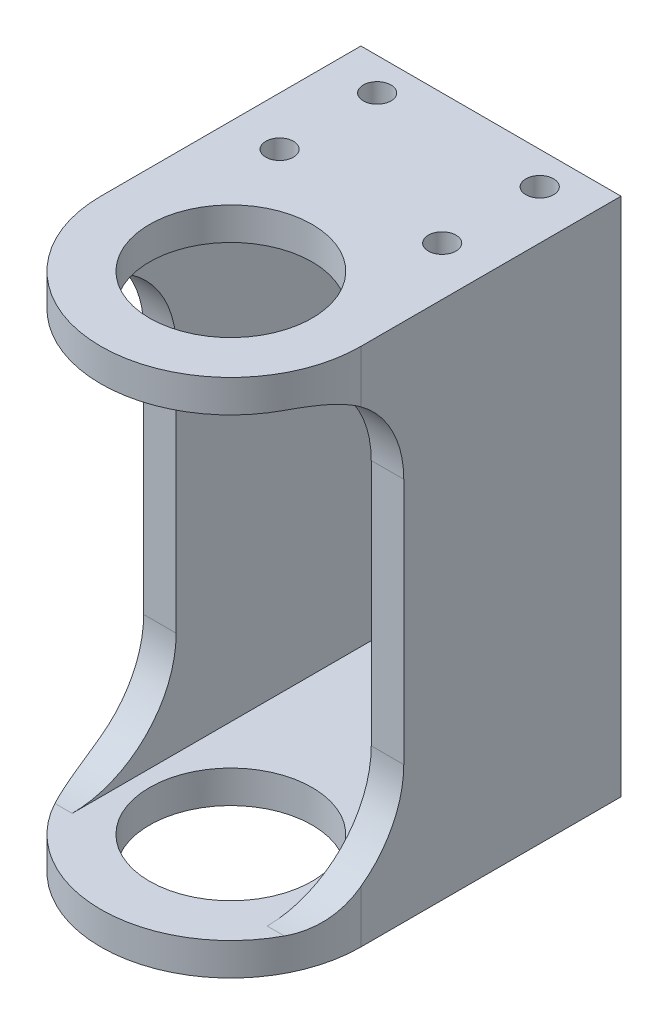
from build123d import *

# Parameters (mm, degrees)
SKETCH1_W                 = 25.4
SKETCH1_H                 = 50.8
SKETCH1_W_2               = 19.05
SKETCH1_H_2               = 44.45
EXTRUDE1_DEPTH            = 38.1
SKETCH2_R                 = 7.9375
CUT_EXTRUDE1_DEPTH        = 65.757547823
SKETCH3_W                 = 24.30883312
SKETCH3_H                 = 44.45
CUT_EXTRUDE2_DEPTH        = 53.363441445
F_6_32_TAPPED_HOLE1_D     = 2.7051
F_6_32_TAPPED_HOLE1_DEPTH = 3.175
FILLET2_R                 = 10.16


with BuildPart() as part:
    # Sketch1 → Extrude1 (new body)
    with BuildSketch(Plane.XY):
        Rectangle(SKETCH1_W, SKETCH1_H)
        Rectangle(SKETCH1_W_2, SKETCH1_H_2, mode=Mode.SUBTRACT)
    extrude(amount=EXTRUDE1_DEPTH)

    # Sketch2 → Cut-Extrude1 (cut, through all)
    with BuildSketch(Plane(origin=(0, 25.4, 0), x_dir=(-1, 0, 0), z_dir=(0, 1, 0))):
        with Locations(Location((0, 25.4, 0), (0, 0, 90))):
            Circle(SKETCH2_R)
        with BuildLine():
            Line((-12.7, 19.05), (-12.7, 25.4))
            ThreePointArc((-12.7, 25.4), (0, 38.1), (12.7, 25.4))
            Line((12.7, 25.4), (12.7, 19.05))
            Line((12.7, 19.05), (20.468775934, 39.416071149))
            Line((20.468775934, 39.416071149), (-20.985389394, 39.416071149))
            Line((-20.985389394, 39.416071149), (-20.985389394, 19.05))
            Line((-20.985389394, 19.05), (-12.7, 19.05))
        make_face()
    extrude(amount=-CUT_EXTRUDE1_DEPTH, mode=Mode.SUBTRACT)

    # Sketch3 → Cut-Extrude2 (cut, through all)
    with BuildSketch(Plane(origin=(12.7, 0, 0), x_dir=(0, 0, -1), z_dir=(1, 0, 0))):
        with Locations((-33.369023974, 0)):
            Rectangle(SKETCH3_W, SKETCH3_H)
    extrude(amount=-CUT_EXTRUDE2_DEPTH, mode=Mode.SUBTRACT)

    # 6-32 Tapped Hole1
    with Locations(Plane(origin=(-2.434727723, 25.4, -0.901468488), x_dir=(1, 0, 0), z_dir=(0, 1, 0))):
        with Locations((10.372227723, -13.601468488), (10.372227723, -4.076468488), (-5.502772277, -4.076468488), (-5.502772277, -13.601468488)):
            Hole(F_6_32_TAPPED_HOLE1_D / 2, depth=F_6_32_TAPPED_HOLE1_DEPTH)

    # Fillet2
    fillet2_edges = [part.edges().sort_by_distance(p)[0] for p in [
        (11.1125, 22.225, 21.214607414),
        (-11.1125, 22.225, 21.214607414),
        (-11.1125, -22.225, 21.214607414),
        (11.1125, -22.225, 21.214607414),
    ]]
    fillet(fillet2_edges, radius=FILLET2_R)


solid = part.part
